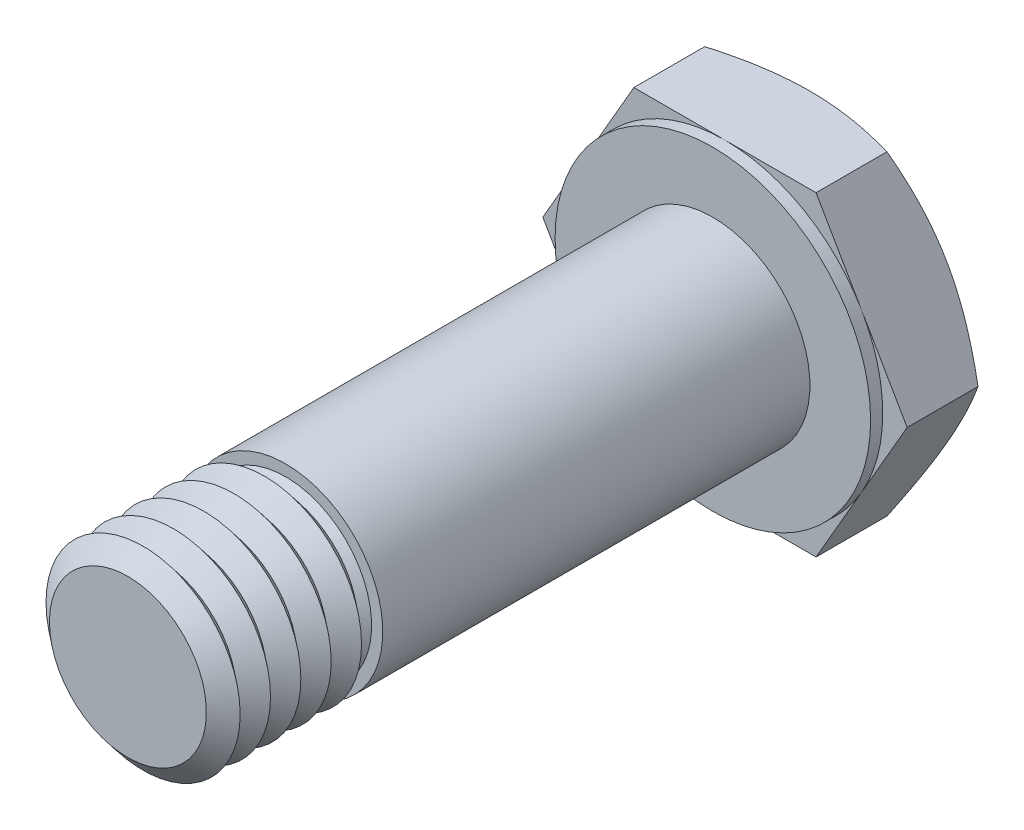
ISO-10303-21;
HEADER;
FILE_DESCRIPTION(('STEP AP214'),'2;1');
FILE_NAME('part.step','',(''),(''),'','','');
FILE_SCHEMA(('AUTOMOTIVE_DESIGN { 1 0 10303 214 1 1 1 1 }'));
ENDSEC;
DATA;
#1=APPLICATION_CONTEXT('core data for automotive mechanical design processes');
#2=APPLICATION_PROTOCOL_DEFINITION('international standard','automotive_design',2000,#1);
#3=PRODUCT_CONTEXT('',#1,'mechanical');
#4=PRODUCT('Part','Part','',(#3));
#5=PRODUCT_RELATED_PRODUCT_CATEGORY('part','',(#4));
#6=PRODUCT_DEFINITION_FORMATION('','',#4);
#7=PRODUCT_DEFINITION_CONTEXT('part definition',#1,'design');
#8=PRODUCT_DEFINITION('design','',#6,#7);
#9=PRODUCT_DEFINITION_SHAPE('','',#8);
#10=(LENGTH_UNIT() NAMED_UNIT(*) SI_UNIT(.MILLI.,.METRE.));
#11=(NAMED_UNIT(*) PLANE_ANGLE_UNIT() SI_UNIT($,.RADIAN.));
#12=(NAMED_UNIT(*) SI_UNIT($,.STERADIAN.) SOLID_ANGLE_UNIT());
#13=UNCERTAINTY_MEASURE_WITH_UNIT(LENGTH_MEASURE(1.E-05),#10,'distance_accuracy_value','');
#14=(GEOMETRIC_REPRESENTATION_CONTEXT(3) GLOBAL_UNCERTAINTY_ASSIGNED_CONTEXT((#13)) GLOBAL_UNIT_ASSIGNED_CONTEXT((#10,
#11,#12)) REPRESENTATION_CONTEXT('',''));
#15=CARTESIAN_POINT('',(0.,0.,0.));
#16=DIRECTION('',(0.,0.,1.));
#17=DIRECTION('',(1.,0.,0.));
#18=AXIS2_PLACEMENT_3D('',#15,#16,#17);
#19=CARTESIAN_POINT('',(0.,0.,24.1000000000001));
#20=DIRECTION('',(0.,0.,-1.));
#21=DIRECTION('',(-1.,0.,0.));
#22=AXIS2_PLACEMENT_3D('',#19,#20,#21);
#23=PLANE('',#22);
#24=CARTESIAN_POINT('',(0.,0.,24.1000000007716));
#25=DIRECTION('',(0.,0.,-1.));
#26=DIRECTION('',(-1.,0.,0.));
#27=AXIS2_PLACEMENT_3D('',#24,#25,#26);
#28=CIRCLE('',#27,3.23300000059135);
#29=CARTESIAN_POINT('',(-3.23300000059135,0.,24.1000000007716));
#30=VERTEX_POINT('',#29);
#31=EDGE_CURVE('E19',#30,#30,#28,.T.);
#32=ORIENTED_EDGE('',*,*,#31,.F.);
#33=EDGE_LOOP('',(#32));
#34=FACE_BOUND('',#33,.T.);
#35=ADVANCED_FACE('F16',(#34),#23,.F.);
#36=CARTESIAN_POINT('',(0.,0.,23.475000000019));
#37=DIRECTION('',(0.,0.,-1.));
#38=DIRECTION('',(-1.,0.,0.));
#39=AXIS2_PLACEMENT_3D('',#36,#37,#38);
#40=CONICAL_SURFACE('',#39,3.99999999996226,0.887057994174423);
#41=CARTESIAN_POINT('',(0.,0.,23.475000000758));
#42=DIRECTION('',(0.,0.,1.));
#43=DIRECTION('',(1.,0.,0.));
#44=AXIS2_PLACEMENT_3D('',#41,#42,#43);
#45=CIRCLE('',#44,3.99999999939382);
#46=CARTESIAN_POINT('',(3.99999999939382,0.,23.475000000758));
#47=VERTEX_POINT('',#46);
#48=EDGE_CURVE('E357',#47,#47,#45,.F.);
#49=ORIENTED_EDGE('',*,*,#48,.F.);
#50=EDGE_LOOP('',(#49));
#51=FACE_BOUND('',#50,.T.);
#52=ORIENTED_EDGE('',*,*,#31,.T.);
#53=EDGE_LOOP('',(#52));
#54=FACE_BOUND('',#53,.T.);
#55=ADVANCED_FACE('F436',(#51,#54),#40,.T.);
#56=CARTESIAN_POINT('',(0.,0.,23.4750000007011));
#57=DIRECTION('',(0.,0.,1.));
#58=DIRECTION('',(1.,0.,0.));
#59=AXIS2_PLACEMENT_3D('',#56,#57,#58);
#60=CONICAL_SURFACE('',#59,3.99999999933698,0.887057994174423);
#61=CARTESIAN_POINT('',(0.,0.,22.8500000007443));
#62=DIRECTION('',(0.,0.,-1.));
#63=DIRECTION('',(1.,0.,0.));
#64=AXIS2_PLACEMENT_3D('',#61,#62,#63);
#65=CIRCLE('',#64,3.23300000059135);
#66=CARTESIAN_POINT('',(3.23300000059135,0.,22.8500000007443));
#67=VERTEX_POINT('',#66);
#68=EDGE_CURVE('E352',#67,#67,#65,.T.);
#69=ORIENTED_EDGE('',*,*,#68,.F.);
#70=EDGE_LOOP('',(#69));
#71=FACE_BOUND('',#70,.T.);
#72=ORIENTED_EDGE('',*,*,#48,.T.);
#73=EDGE_LOOP('',(#72));
#74=FACE_BOUND('',#73,.T.);
#75=ADVANCED_FACE('F430',(#71,#74),#60,.T.);
#76=CARTESIAN_POINT('',(0.,0.,22.2249999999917));
#77=DIRECTION('',(0.,0.,-1.));
#78=DIRECTION('',(-1.,0.,0.));
#79=AXIS2_PLACEMENT_3D('',#76,#77,#78);
#80=CONICAL_SURFACE('',#79,3.99999999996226,0.887057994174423);
#81=CARTESIAN_POINT('',(0.,0.,22.2250000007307));
#82=DIRECTION('',(0.,0.,1.));
#83=DIRECTION('',(1.,0.,0.));
#84=AXIS2_PLACEMENT_3D('',#81,#82,#83);
#85=CIRCLE('',#84,3.99999999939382);
#86=CARTESIAN_POINT('',(3.99999999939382,0.,22.2250000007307));
#87=VERTEX_POINT('',#86);
#88=EDGE_CURVE('E347',#87,#87,#85,.F.);
#89=ORIENTED_EDGE('',*,*,#88,.F.);
#90=EDGE_LOOP('',(#89));
#91=FACE_BOUND('',#90,.T.);
#92=ORIENTED_EDGE('',*,*,#68,.T.);
#93=EDGE_LOOP('',(#92));
#94=FACE_BOUND('',#93,.T.);
#95=ADVANCED_FACE('F424',(#91,#94),#80,.T.);
#96=CARTESIAN_POINT('',(0.,0.,22.2250000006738));
#97=DIRECTION('',(0.,0.,1.));
#98=DIRECTION('',(1.,0.,0.));
#99=AXIS2_PLACEMENT_3D('',#96,#97,#98);
#100=CONICAL_SURFACE('',#99,3.99999999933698,0.887057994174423);
#101=CARTESIAN_POINT('',(0.,0.,21.6000000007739));
#102=DIRECTION('',(0.,0.,-1.));
#103=DIRECTION('',(1.,0.,0.));
#104=AXIS2_PLACEMENT_3D('',#101,#102,#103);
#105=CIRCLE('',#104,3.23300000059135);
#106=CARTESIAN_POINT('',(3.23300000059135,0.,21.6000000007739));
#107=VERTEX_POINT('',#106);
#108=EDGE_CURVE('E342',#107,#107,#105,.T.);
#109=ORIENTED_EDGE('',*,*,#108,.F.);
#110=EDGE_LOOP('',(#109));
#111=FACE_BOUND('',#110,.T.);
#112=ORIENTED_EDGE('',*,*,#88,.T.);
#113=EDGE_LOOP('',(#112));
#114=FACE_BOUND('',#113,.T.);
#115=ADVANCED_FACE('F418',(#111,#114),#100,.T.);
#116=CARTESIAN_POINT('',(0.,0.,20.9750000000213));
#117=DIRECTION('',(0.,0.,-1.));
#118=DIRECTION('',(-1.,0.,0.));
#119=AXIS2_PLACEMENT_3D('',#116,#117,#118);
#120=CONICAL_SURFACE('',#119,3.99999999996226,0.887057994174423);
#121=CARTESIAN_POINT('',(0.,0.,20.9750000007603));
#122=DIRECTION('',(0.,0.,1.));
#123=DIRECTION('',(1.,0.,0.));
#124=AXIS2_PLACEMENT_3D('',#121,#122,#123);
#125=CIRCLE('',#124,3.99999999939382);
#126=CARTESIAN_POINT('',(3.99999999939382,0.,20.9750000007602));
#127=VERTEX_POINT('',#126);
#128=EDGE_CURVE('E337',#127,#127,#125,.F.);
#129=ORIENTED_EDGE('',*,*,#128,.F.);
#130=EDGE_LOOP('',(#129));
#131=FACE_BOUND('',#130,.T.);
#132=ORIENTED_EDGE('',*,*,#108,.T.);
#133=EDGE_LOOP('',(#132));
#134=FACE_BOUND('',#133,.T.);
#135=ADVANCED_FACE('F412',(#131,#134),#120,.T.);
#136=CARTESIAN_POINT('',(0.,0.,20.9750000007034));
#137=DIRECTION('',(0.,0.,1.));
#138=DIRECTION('',(1.,0.,0.));
#139=AXIS2_PLACEMENT_3D('',#136,#137,#138);
#140=CONICAL_SURFACE('',#139,3.99999999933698,0.887057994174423);
#141=CARTESIAN_POINT('',(0.,0.,20.3500000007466));
#142=DIRECTION('',(0.,0.,-1.));
#143=DIRECTION('',(1.,0.,0.));
#144=AXIS2_PLACEMENT_3D('',#141,#142,#143);
#145=CIRCLE('',#144,3.23300000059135);
#146=CARTESIAN_POINT('',(3.23300000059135,0.,20.3500000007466));
#147=VERTEX_POINT('',#146);
#148=EDGE_CURVE('E101',#147,#147,#145,.T.);
#149=ORIENTED_EDGE('',*,*,#148,.F.);
#150=EDGE_LOOP('',(#149));
#151=FACE_BOUND('',#150,.T.);
#152=ORIENTED_EDGE('',*,*,#128,.T.);
#153=EDGE_LOOP('',(#152));
#154=FACE_BOUND('',#153,.T.);
#155=ADVANCED_FACE('F409',(#151,#154),#140,.T.);
#156=CARTESIAN_POINT('',(0.,0.,-4.));
#157=DIRECTION('',(0.,0.,-1.));
#158=DIRECTION('',(-1.,0.,0.));
#159=AXIS2_PLACEMENT_3D('',#156,#157,#158);
#160=PLANE('',#159);
#161=CARTESIAN_POINT('',(0.,0.,-4.00000000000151));
#162=DIRECTION('',(0.,0.,1.));
#163=DIRECTION('',(1.,0.,0.));
#164=AXIS2_PLACEMENT_3D('',#161,#162,#163);
#165=CIRCLE('',#164,6.50000000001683);
#166=CARTESIAN_POINT('',(-5.62916512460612,3.25000000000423,-4.00000000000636));
#167=VERTEX_POINT('',#166);
#168=CARTESIAN_POINT('',(-5.62916512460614,-3.25000000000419,-4.00000000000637));
#169=VERTEX_POINT('',#168);
#170=EDGE_CURVE('E93',#167,#169,#165,.T.);
#171=ORIENTED_EDGE('',*,*,#170,.F.);
#172=CARTESIAN_POINT('',(0.,0.,-4.00000000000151));
#173=DIRECTION('',(0.,0.,1.));
#174=DIRECTION('',(1.,0.,0.));
#175=AXIS2_PLACEMENT_3D('',#172,#173,#174);
#176=CIRCLE('',#175,6.50000000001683);
#177=CARTESIAN_POINT('',(0.,6.50000000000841,-4.00000000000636));
#178=VERTEX_POINT('',#177);
#179=EDGE_CURVE('E130',#178,#167,#176,.T.);
#180=ORIENTED_EDGE('',*,*,#179,.F.);
#181=CARTESIAN_POINT('',(0.,0.,-4.00000000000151));
#182=DIRECTION('',(0.,0.,1.));
#183=DIRECTION('',(1.,0.,0.));
#184=AXIS2_PLACEMENT_3D('',#181,#182,#183);
#185=CIRCLE('',#184,6.50000000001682);
#186=CARTESIAN_POINT('',(5.62916512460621,3.25000000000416,-4.00000000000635));
#187=VERTEX_POINT('',#186);
#188=EDGE_CURVE('E111',#187,#178,#185,.T.);
#189=ORIENTED_EDGE('',*,*,#188,.F.);
#190=CARTESIAN_POINT('',(0.,0.,-4.00000000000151));
#191=DIRECTION('',(0.,0.,1.));
#192=DIRECTION('',(1.,0.,0.));
#193=AXIS2_PLACEMENT_3D('',#190,#191,#192);
#194=CIRCLE('',#193,6.50000000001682);
#195=CARTESIAN_POINT('',(5.62916512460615,-3.25000000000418,-4.00000000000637));
#196=VERTEX_POINT('',#195);
#197=EDGE_CURVE('E112',#196,#187,#194,.T.);
#198=ORIENTED_EDGE('',*,*,#197,.F.);
#199=CARTESIAN_POINT('',(0.,0.,-4.00000000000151));
#200=DIRECTION('',(0.,0.,1.));
#201=DIRECTION('',(1.,0.,0.));
#202=AXIS2_PLACEMENT_3D('',#199,#200,#201);
#203=CIRCLE('',#202,6.50000000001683);
#204=CARTESIAN_POINT('',(0.,-6.50000000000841,-4.00000000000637));
#205=VERTEX_POINT('',#204);
#206=EDGE_CURVE('E96',#205,#196,#203,.T.);
#207=ORIENTED_EDGE('',*,*,#206,.F.);
#208=CARTESIAN_POINT('',(0.,0.,-4.00000000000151));
#209=DIRECTION('',(0.,0.,1.));
#210=DIRECTION('',(1.,0.,0.));
#211=AXIS2_PLACEMENT_3D('',#208,#209,#210);
#212=CIRCLE('',#211,6.50000000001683);
#213=EDGE_CURVE('E90',#169,#205,#212,.T.);
#214=ORIENTED_EDGE('',*,*,#213,.F.);
#215=EDGE_LOOP('',(#171,#180,#189,#198,#207,#214));
#216=FACE_BOUND('',#215,.T.);
#217=ADVANCED_FACE('F92',(#216),#160,.T.);
#218=CARTESIAN_POINT('',(0.,0.,19.724999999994));
#219=DIRECTION('',(0.,0.,-1.));
#220=DIRECTION('',(-1.,0.,0.));
#221=AXIS2_PLACEMENT_3D('',#218,#219,#220);
#222=CONICAL_SURFACE('',#221,3.99999999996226,0.887057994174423);
#223=CARTESIAN_POINT('',(0.,0.,19.725000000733));
#224=DIRECTION('',(0.,0.,1.));
#225=DIRECTION('',(1.,0.,0.));
#226=AXIS2_PLACEMENT_3D('',#223,#224,#225);
#227=CIRCLE('',#226,3.99999999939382);
#228=CARTESIAN_POINT('',(3.99999999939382,0.,19.725000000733));
#229=VERTEX_POINT('',#228);
#230=EDGE_CURVE('E127',#229,#229,#227,.F.);
#231=ORIENTED_EDGE('',*,*,#230,.F.);
#232=EDGE_LOOP('',(#231));
#233=FACE_BOUND('',#232,.T.);
#234=ORIENTED_EDGE('',*,*,#148,.T.);
#235=EDGE_LOOP('',(#234));
#236=FACE_BOUND('',#235,.T.);
#237=ADVANCED_FACE('F229',(#233,#236),#222,.T.);
#238=CARTESIAN_POINT('',(0.,0.,-3.41596007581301));
#239=DIRECTION('',(0.,0.,1.));
#240=DIRECTION('',(1.,0.,0.));
#241=AXIS2_PLACEMENT_3D('',#238,#239,#240);
#242=CONICAL_SURFACE('',#241,7.51158681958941,1.04719755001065);
#243=CARTESIAN_POINT('',(-5.62916512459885,-3.24999999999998,-4.00000000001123));
#244=CARTESIAN_POINT('',(-5.54952296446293,-3.38794426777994,-4.00002656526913));
#245=CARTESIAN_POINT('',(-5.46988464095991,-3.52588189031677,-3.99662027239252));
#246=CARTESIAN_POINT('',(-5.31076436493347,-3.80148629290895,-3.98313941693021));
#247=CARTESIAN_POINT('',(-5.23128238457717,-3.93915312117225,-3.97306617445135));
#248=CARTESIAN_POINT('',(-5.07298818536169,-4.21332671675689,-3.94651519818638));
#249=CARTESIAN_POINT('',(-4.99417460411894,-4.3498358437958,-3.93006970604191));
#250=CARTESIAN_POINT('',(-4.83692293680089,-4.62220372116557,-3.89112797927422));
#251=CARTESIAN_POINT('',(-4.7584848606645,-4.75806245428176,-3.86863158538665));
#252=CARTESIAN_POINT('',(-4.52405902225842,-5.16409991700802,-3.79276102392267));
#253=CARTESIAN_POINT('',(-4.36875227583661,-5.43309909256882,-3.73096863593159));
#254=CARTESIAN_POINT('',(-4.05947435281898,-5.96878416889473,-3.58845958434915));
#255=CARTESIAN_POINT('',(-3.90551396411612,-6.23545138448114,-3.50764840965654));
#256=CARTESIAN_POINT('',(-3.75277674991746,-6.49999999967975,-3.41944341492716));
#257=B_SPLINE_CURVE_WITH_KNOTS('',3,(#243,#244,#245,#246,#247,#248,#249,#250,#251,#252,#253,
#254,#255,#256),.UNSPECIFIED.,.F.,.F.,(4,2,2,2,2,2,4),(0.,0.477804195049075,0.955513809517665,
1.4308372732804,1.9061732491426,2.85559935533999,3.8098470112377),.UNSPECIFIED.);
#258=CARTESIAN_POINT('',(-3.75277674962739,-6.49999999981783,-3.41944341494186));
#259=VERTEX_POINT('',#258);
#260=EDGE_CURVE('E114',#169,#259,#257,.T.);
#261=ORIENTED_EDGE('',*,*,#260,.F.);
#262=ORIENTED_EDGE('',*,*,#213,.T.);
#263=CARTESIAN_POINT('',(-3.75277674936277,-6.50000000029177,-3.41944341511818));
#264=CARTESIAN_POINT('',(-3.44730232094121,-6.50000000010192,-3.50764840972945));
#265=CARTESIAN_POINT('',(-3.13938154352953,-6.50000000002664,-3.58845958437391));
#266=CARTESIAN_POINT('',(-2.52082569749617,-6.4999999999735,-3.7309686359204));
#267=CARTESIAN_POINT('',(-2.21021220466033,-6.49999999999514,-3.79276102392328));
#268=CARTESIAN_POINT('',(-1.74136052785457,-6.50000000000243,-3.86863158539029));
#269=CARTESIAN_POINT('',(-1.58448437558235,-6.50000000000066,-3.89112797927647));
#270=CARTESIAN_POINT('',(-1.2699810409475,-6.49999999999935,-3.93006970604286));
#271=CARTESIAN_POINT('',(-1.11235387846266,-6.49999999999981,-3.94651519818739));
#272=CARTESIAN_POINT('',(-0.795765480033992,-6.50000000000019,-3.9730661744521));
#273=CARTESIAN_POINT('',(-0.636801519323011,-6.5000000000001,-3.98313941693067));
#274=CARTESIAN_POINT('',(-0.318560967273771,-6.49999999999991,-3.99662027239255));
#275=CARTESIAN_POINT('',(-0.159284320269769,-6.49999999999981,-4.00002656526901));
#276=CARTESIAN_POINT('',(0.,-6.5,-4.00000000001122));
#277=B_SPLINE_CURVE_WITH_KNOTS('',3,(#263,#264,#265,#266,#267,#268,#269,#270,#271,#272,#273,
#274,#275,#276),.UNSPECIFIED.,.F.,.F.,(4,2,2,2,2,2,4),(0.,0.954247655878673,1.90367376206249,
2.37900973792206,2.85433320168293,3.3320428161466,3.80984701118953),.UNSPECIFIED.);
#278=EDGE_CURVE('E117',#259,#205,#277,.T.);
#279=ORIENTED_EDGE('',*,*,#278,.F.);
#280=EDGE_LOOP('',(#261,#262,#279));
#281=FACE_BOUND('',#280,.T.);
#282=ADVANCED_FACE('F115',(#281),#242,.T.);
#283=CARTESIAN_POINT('',(0.,0.,-3.41596007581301));
#284=DIRECTION('',(0.,0.,1.));
#285=DIRECTION('',(1.,0.,0.));
#286=AXIS2_PLACEMENT_3D('',#283,#284,#285);
#287=CONICAL_SURFACE('',#286,7.51158681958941,1.04719755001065);
#288=CARTESIAN_POINT('',(0.,-6.5,-4.00000000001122));
#289=CARTESIAN_POINT('',(0.159284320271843,-6.5,-4.00002656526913));
#290=CARTESIAN_POINT('',(0.318560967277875,-6.5,-3.99662027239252));
#291=CARTESIAN_POINT('',(0.636801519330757,-6.5,-3.9831394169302));
#292=CARTESIAN_POINT('',(0.795765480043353,-6.5,-3.97306617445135));
#293=CARTESIAN_POINT('',(1.11235387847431,-6.5,-3.94651519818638));
#294=CARTESIAN_POINT('',(1.26998104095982,-6.5,-3.93006970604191));
#295=CARTESIAN_POINT('',(1.58448437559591,-6.5,-3.89112797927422));
#296=CARTESIAN_POINT('',(1.74136052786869,-6.5,-3.86863158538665));
#297=CARTESIAN_POINT('',(2.21021220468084,-6.5,-3.79276102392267));
#298=CARTESIAN_POINT('',(2.52082569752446,-6.5,-3.73096863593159));
#299=CARTESIAN_POINT('',(3.13938154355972,-6.5,-3.58845958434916));
#300=CARTESIAN_POINT('',(3.44730232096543,-6.5,-3.50764840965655));
#301=CARTESIAN_POINT('',(3.75277674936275,-6.5,-3.41944341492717));
#302=B_SPLINE_CURVE_WITH_KNOTS('',3,(#288,#289,#290,#291,#292,#293,#294,#295,#296,#297,#298,
#299,#300,#301),.UNSPECIFIED.,.F.,.F.,(4,2,2,2,2,2,4),(0.,0.477804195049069,0.955513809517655,
1.43083727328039,1.90617324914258,2.85559935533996,3.80984701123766),.UNSPECIFIED.);
#303=CARTESIAN_POINT('',(3.75277674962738,-6.49999999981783,-3.41944341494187));
#304=VERTEX_POINT('',#303);
#305=EDGE_CURVE('E217',#205,#304,#302,.T.);
#306=ORIENTED_EDGE('',*,*,#305,.F.);
#307=ORIENTED_EDGE('',*,*,#206,.T.);
#308=CARTESIAN_POINT('',(3.75277675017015,-6.49999999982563,-3.4194434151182));
#309=CARTESIAN_POINT('',(3.9055139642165,-6.2354513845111,-3.50764840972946));
#310=CARTESIAN_POINT('',(4.05947435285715,-5.96878416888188,-3.58845958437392));
#311=CARTESIAN_POINT('',(4.36875227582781,-5.43309909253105,-3.73096863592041));
#312=CARTESIAN_POINT('',(4.52405902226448,-5.16409991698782,-3.79276102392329));
#313=CARTESIAN_POINT('',(4.75848486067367,-4.75806245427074,-3.8686315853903));
#314=CARTESIAN_POINT('',(4.83692293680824,-4.62220372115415,-3.89112797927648));
#315=CARTESIAN_POINT('',(4.99417460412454,-4.34983584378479,-3.93006970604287));
#316=CARTESIAN_POINT('',(5.07298818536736,-4.2133267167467,-3.9465151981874));
#317=CARTESIAN_POINT('',(5.23128238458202,-3.93915312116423,-3.97306617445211));
#318=CARTESIAN_POINT('',(5.31076436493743,-3.80148629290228,-3.98313941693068));
#319=CARTESIAN_POINT('',(5.46988464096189,-3.52588189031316,-3.99662027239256));
#320=CARTESIAN_POINT('',(5.54952296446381,-3.38794426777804,-4.00002656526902));
#321=CARTESIAN_POINT('',(5.62916512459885,-3.24999999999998,-4.00000000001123));
#322=B_SPLINE_CURVE_WITH_KNOTS('',3,(#308,#309,#310,#311,#312,#313,#314,#315,#316,#317,#318,
#319,#320,#321),.UNSPECIFIED.,.F.,.F.,(4,2,2,2,2,2,4),(0.,0.954247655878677,1.9036737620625,
2.37900973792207,2.85433320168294,3.33204281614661,3.80984701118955),.UNSPECIFIED.);
#323=EDGE_CURVE('E210',#304,#196,#322,.T.);
#324=ORIENTED_EDGE('',*,*,#323,.F.);
#325=EDGE_LOOP('',(#306,#307,#324));
#326=FACE_BOUND('',#325,.T.);
#327=ADVANCED_FACE('F221',(#326),#287,.T.);
#328=CARTESIAN_POINT('',(0.,0.,-3.41596007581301));
#329=DIRECTION('',(0.,0.,1.));
#330=DIRECTION('',(1.,0.,0.));
#331=AXIS2_PLACEMENT_3D('',#328,#329,#330);
#332=CONICAL_SURFACE('',#331,7.51158681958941,1.04719755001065);
#333=ORIENTED_EDGE('',*,*,#197,.T.);
#334=CARTESIAN_POINT('',(7.50555349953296,4.66183082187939E-10,-3.41944341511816));
#335=CARTESIAN_POINT('',(7.35281628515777,0.264548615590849,-3.50764840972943));
#336=CARTESIAN_POINT('',(7.19885589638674,0.531215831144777,-3.58845958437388));
#337=CARTESIAN_POINT('',(6.88957797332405,1.06690090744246,-3.73096863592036));
#338=CARTESIAN_POINT('',(6.73427122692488,1.33590008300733,-3.79276102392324));
#339=CARTESIAN_POINT('',(6.49984538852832,1.74193754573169,-3.86863158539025));
#340=CARTESIAN_POINT('',(6.42140731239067,1.8777962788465,-3.89112797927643));
#341=CARTESIAN_POINT('',(6.26415564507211,2.15016415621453,-3.93006970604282));
#342=CARTESIAN_POINT('',(6.1853420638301,2.28667328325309,-3.94651519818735));
#343=CARTESIAN_POINT('',(6.0270478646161,2.56084687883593,-3.97306617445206));
#344=CARTESIAN_POINT('',(5.94756588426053,2.69851370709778,-3.98313941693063));
#345=CARTESIAN_POINT('',(5.78844560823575,2.9741181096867,-3.9966202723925));
#346=CARTESIAN_POINT('',(5.70880728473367,3.11205573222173,-4.00002656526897));
#347=CARTESIAN_POINT('',(5.62916512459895,3.24999999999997,-4.00000000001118));
#348=B_SPLINE_CURVE_WITH_KNOTS('',3,(#334,#335,#336,#337,#338,#339,#340,#341,#342,#343,#344,
#345,#346,#347),.UNSPECIFIED.,.F.,.F.,(4,2,2,2,2,2,4),(0.,0.95424765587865,1.90367376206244,
2.379009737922,2.85433320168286,3.33204281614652,3.80984701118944),.UNSPECIFIED.);
#349=CARTESIAN_POINT('',(7.50555349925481,0.,-3.41944341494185));
#350=VERTEX_POINT('',#349);
#351=EDGE_CURVE('E198',#350,#187,#348,.T.);
#352=ORIENTED_EDGE('',*,*,#351,.F.);
#353=CARTESIAN_POINT('',(5.62916512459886,-3.24999999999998,-4.00000000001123));
#354=CARTESIAN_POINT('',(5.70880728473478,-3.11205573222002,-4.00002656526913));
#355=CARTESIAN_POINT('',(5.78844560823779,-2.97411810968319,-3.99662027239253));
#356=CARTESIAN_POINT('',(5.94756588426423,-2.69851370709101,-3.98313941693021));
#357=CARTESIAN_POINT('',(6.02704786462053,-2.56084687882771,-3.97306617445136));
#358=CARTESIAN_POINT('',(6.18534206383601,-2.28667328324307,-3.94651519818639));
#359=CARTESIAN_POINT('',(6.26415564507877,-2.15016415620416,-3.93006970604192));
#360=CARTESIAN_POINT('',(6.42140731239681,-1.87779627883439,-3.89112797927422));
#361=CARTESIAN_POINT('',(6.4998453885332,-1.74193754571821,-3.86863158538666));
#362=CARTESIAN_POINT('',(6.73427122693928,-1.33590008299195,-3.79276102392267));
#363=CARTESIAN_POINT('',(6.88957797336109,-1.06690090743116,-3.73096863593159));
#364=CARTESIAN_POINT('',(7.19885589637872,-0.531215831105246,-3.58845958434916));
#365=CARTESIAN_POINT('',(7.35281628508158,-0.264548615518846,-3.50764840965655));
#366=CARTESIAN_POINT('',(7.50555349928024,-3.20235474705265E-10,-3.41944341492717));
#367=B_SPLINE_CURVE_WITH_KNOTS('',3,(#353,#354,#355,#356,#357,#358,#359,#360,#361,#362,#363,
#364,#365,#366),.UNSPECIFIED.,.F.,.F.,(4,2,2,2,2,2,4),(0.,0.47780419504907,0.955513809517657,
1.43083727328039,1.90617324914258,2.85559935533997,3.80984701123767),.UNSPECIFIED.);
#368=EDGE_CURVE('E205',#196,#350,#367,.T.);
#369=ORIENTED_EDGE('',*,*,#368,.F.);
#370=EDGE_LOOP('',(#333,#352,#369));
#371=FACE_BOUND('',#370,.T.);
#372=ADVANCED_FACE('F152',(#371),#332,.T.);
#373=CARTESIAN_POINT('',(0.,0.,-3.41596007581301));
#374=DIRECTION('',(0.,0.,1.));
#375=DIRECTION('',(1.,0.,0.));
#376=AXIS2_PLACEMENT_3D('',#373,#374,#375);
#377=CONICAL_SURFACE('',#376,7.51158681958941,1.04719755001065);
#378=CARTESIAN_POINT('',(-5.62916512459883,3.25000000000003,-4.00000000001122));
#379=CARTESIAN_POINT('',(-5.70880728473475,3.11205573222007,-4.00002656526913));
#380=CARTESIAN_POINT('',(-5.78844560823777,2.97411810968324,-3.99662027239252));
#381=CARTESIAN_POINT('',(-5.94756588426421,2.69851370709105,-3.9831394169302));
#382=CARTESIAN_POINT('',(-6.02704786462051,2.56084687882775,-3.97306617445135));
#383=CARTESIAN_POINT('',(-6.18534206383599,2.28667328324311,-3.94651519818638));
#384=CARTESIAN_POINT('',(-6.26415564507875,2.1501641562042,-3.93006970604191));
#385=CARTESIAN_POINT('',(-6.42140731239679,1.87779627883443,-3.89112797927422));
#386=CARTESIAN_POINT('',(-6.49984538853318,1.74193754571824,-3.86863158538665));
#387=CARTESIAN_POINT('',(-6.73427122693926,1.33590008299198,-3.79276102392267));
#388=CARTESIAN_POINT('',(-6.88957797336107,1.06690090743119,-3.73096863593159));
#389=CARTESIAN_POINT('',(-7.19885589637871,0.531215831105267,-3.58845958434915));
#390=CARTESIAN_POINT('',(-7.35281628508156,0.264548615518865,-3.50764840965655));
#391=CARTESIAN_POINT('',(-7.50555349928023,3.20252152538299E-10,-3.41944341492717));
#392=B_SPLINE_CURVE_WITH_KNOTS('',3,(#378,#379,#380,#381,#382,#383,#384,#385,#386,#387,#388,
#389,#390,#391),.UNSPECIFIED.,.F.,.F.,(4,2,2,2,2,2,4),(0.,0.477804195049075,0.955513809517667,
1.43083727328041,1.9061732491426,2.85559935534,3.8098470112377),.UNSPECIFIED.);
#393=CARTESIAN_POINT('',(-7.50555349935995,-1.82164817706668E-10,-3.41944341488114));
#394=VERTEX_POINT('',#393);
#395=EDGE_CURVE('E109',#167,#394,#392,.T.);
#396=ORIENTED_EDGE('',*,*,#395,.F.);
#397=ORIENTED_EDGE('',*,*,#170,.T.);
#398=CARTESIAN_POINT('',(-7.50555349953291,-4.66133003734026E-10,-3.41944341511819));
#399=CARTESIAN_POINT('',(-7.35281628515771,-0.264548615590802,-3.50764840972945));
#400=CARTESIAN_POINT('',(-7.19885589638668,-0.531215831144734,-3.58845958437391));
#401=CARTESIAN_POINT('',(-6.88957797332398,-1.06690090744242,-3.7309686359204));
#402=CARTESIAN_POINT('',(-6.73427122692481,-1.3359000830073,-3.79276102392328));
#403=CARTESIAN_POINT('',(-6.49984538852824,-1.74193754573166,-3.86863158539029));
#404=CARTESIAN_POINT('',(-6.42140731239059,-1.87779627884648,-3.89112797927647));
#405=CARTESIAN_POINT('',(-6.26415564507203,-2.15016415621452,-3.93006970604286));
#406=CARTESIAN_POINT('',(-6.18534206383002,-2.28667328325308,-3.94651519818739));
#407=CARTESIAN_POINT('',(-6.02704786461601,-2.56084687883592,-3.9730661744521));
#408=CARTESIAN_POINT('',(-5.94756588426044,-2.69851370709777,-3.98313941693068));
#409=CARTESIAN_POINT('',(-5.78844560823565,-2.9741181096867,-3.99662027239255));
#410=CARTESIAN_POINT('',(-5.70880728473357,-3.11205573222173,-4.00002656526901));
#411=CARTESIAN_POINT('',(-5.62916512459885,-3.24999999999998,-4.00000000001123));
#412=B_SPLINE_CURVE_WITH_KNOTS('',3,(#398,#399,#400,#401,#402,#403,#404,#405,#406,#407,#408,
#409,#410,#411),.UNSPECIFIED.,.F.,.F.,(4,2,2,2,2,2,4),(0.,0.95424765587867,1.90367376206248,
2.37900973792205,2.85433320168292,3.33204281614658,3.80984701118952),.UNSPECIFIED.);
#413=EDGE_CURVE('E106',#394,#169,#412,.T.);
#414=ORIENTED_EDGE('',*,*,#413,.F.);
#415=EDGE_LOOP('',(#396,#397,#414));
#416=FACE_BOUND('',#415,.T.);
#417=ADVANCED_FACE('F104',(#416),#377,.T.);
#418=CARTESIAN_POINT('',(0.,0.,-3.41596007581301));
#419=DIRECTION('',(0.,0.,1.));
#420=DIRECTION('',(1.,0.,0.));
#421=AXIS2_PLACEMENT_3D('',#418,#419,#420);
#422=CONICAL_SURFACE('',#421,7.51158681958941,1.04719755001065);
#423=ORIENTED_EDGE('',*,*,#188,.T.);
#424=CARTESIAN_POINT('',(3.75277674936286,6.50000000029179,-3.41944341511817));
#425=CARTESIAN_POINT('',(3.4473023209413,6.50000000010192,-3.50764840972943));
#426=CARTESIAN_POINT('',(3.1393815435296,6.50000000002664,-3.58845958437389));
#427=CARTESIAN_POINT('',(2.52082569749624,6.4999999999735,-3.73096863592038));
#428=CARTESIAN_POINT('',(2.21021220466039,6.49999999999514,-3.79276102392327));
#429=CARTESIAN_POINT('',(1.74136052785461,6.50000000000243,-3.86863158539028));
#430=CARTESIAN_POINT('',(1.58448437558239,6.50000000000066,-3.89112797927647));
#431=CARTESIAN_POINT('',(1.26998104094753,6.49999999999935,-3.93006970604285));
#432=CARTESIAN_POINT('',(1.11235387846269,6.49999999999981,-3.94651519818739));
#433=CARTESIAN_POINT('',(0.795765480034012,6.50000000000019,-3.9730661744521));
#434=CARTESIAN_POINT('',(0.636801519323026,6.5000000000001,-3.98313941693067));
#435=CARTESIAN_POINT('',(0.318560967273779,6.49999999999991,-3.99662027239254));
#436=CARTESIAN_POINT('',(0.159284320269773,6.49999999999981,-4.00002656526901));
#437=CARTESIAN_POINT('',(0.,6.5,-4.00000000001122));
#438=B_SPLINE_CURVE_WITH_KNOTS('',3,(#424,#425,#426,#427,#428,#429,#430,#431,#432,#433,#434,
#435,#436,#437),.UNSPECIFIED.,.F.,.F.,(4,2,2,2,2,2,4),(0.,0.954247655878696,1.90367376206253,
2.37900973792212,2.854333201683,3.33204281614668,3.80984701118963),.UNSPECIFIED.);
#439=CARTESIAN_POINT('',(3.75277674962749,6.49999999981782,-3.41944341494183));
#440=VERTEX_POINT('',#439);
#441=EDGE_CURVE('E166',#440,#178,#438,.T.);
#442=ORIENTED_EDGE('',*,*,#441,.F.);
#443=CARTESIAN_POINT('',(5.62916512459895,3.24999999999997,-4.00000000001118));
#444=CARTESIAN_POINT('',(5.54952296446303,3.38794426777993,-4.00002656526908));
#445=CARTESIAN_POINT('',(5.46988464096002,3.52588189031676,-3.99662027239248));
#446=CARTESIAN_POINT('',(5.31076436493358,3.80148629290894,-3.98313941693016));
#447=CARTESIAN_POINT('',(5.23128238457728,3.93915312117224,-3.97306617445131));
#448=CARTESIAN_POINT('',(5.0729881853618,4.21332671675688,-3.94651519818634));
#449=CARTESIAN_POINT('',(4.99417460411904,4.34983584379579,-3.93006970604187));
#450=CARTESIAN_POINT('',(4.836922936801,4.62220372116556,-3.89112797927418));
#451=CARTESIAN_POINT('',(4.75848486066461,4.75806245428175,-3.86863158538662));
#452=CARTESIAN_POINT('',(4.52405902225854,5.16409991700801,-3.79276102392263));
#453=CARTESIAN_POINT('',(4.36875227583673,5.4330990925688,-3.73096863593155));
#454=CARTESIAN_POINT('',(4.0594743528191,5.96878416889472,-3.58845958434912));
#455=CARTESIAN_POINT('',(3.90551396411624,6.23545138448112,-3.50764840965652));
#456=CARTESIAN_POINT('',(3.75277674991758,6.49999999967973,-3.41944341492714));
#457=B_SPLINE_CURVE_WITH_KNOTS('',3,(#443,#444,#445,#446,#447,#448,#449,#450,#451,#452,#453,
#454,#455,#456),.UNSPECIFIED.,.F.,.F.,(4,2,2,2,2,2,4),(0.,0.477804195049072,0.955513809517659,
1.43083727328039,1.90617324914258,2.85559935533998,3.80984701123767),.UNSPECIFIED.);
#458=EDGE_CURVE('E193',#187,#440,#457,.T.);
#459=ORIENTED_EDGE('',*,*,#458,.F.);
#460=EDGE_LOOP('',(#423,#442,#459));
#461=FACE_BOUND('',#460,.T.);
#462=ADVANCED_FACE('F151',(#461),#422,.T.);
#463=CARTESIAN_POINT('',(0.,0.,-3.41596007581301));
#464=DIRECTION('',(0.,0.,1.));
#465=DIRECTION('',(1.,0.,0.));
#466=AXIS2_PLACEMENT_3D('',#463,#464,#465);
#467=CONICAL_SURFACE('',#466,7.51158681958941,1.04719755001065);
#468=CARTESIAN_POINT('',(0.,6.5,-4.00000000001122));
#469=CARTESIAN_POINT('',(-0.159284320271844,6.5,-4.00002656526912));
#470=CARTESIAN_POINT('',(-0.318560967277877,6.5,-3.99662027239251));
#471=CARTESIAN_POINT('',(-0.63680151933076,6.5,-3.9831394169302));
#472=CARTESIAN_POINT('',(-0.795765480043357,6.5,-3.97306617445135));
#473=CARTESIAN_POINT('',(-1.11235387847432,6.5,-3.94651519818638));
#474=CARTESIAN_POINT('',(-1.26998104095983,6.5,-3.93006970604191));
#475=CARTESIAN_POINT('',(-1.58448437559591,6.5,-3.89112797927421));
#476=CARTESIAN_POINT('',(-1.74136052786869,6.5,-3.86863158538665));
#477=CARTESIAN_POINT('',(-2.21021220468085,6.5,-3.79276102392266));
#478=CARTESIAN_POINT('',(-2.52082569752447,6.5,-3.73096863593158));
#479=CARTESIAN_POINT('',(-3.13938154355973,6.5,-3.58845958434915));
#480=CARTESIAN_POINT('',(-3.44730232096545,6.5,-3.50764840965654));
#481=CARTESIAN_POINT('',(-3.75277674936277,6.5,-3.41944341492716));
#482=B_SPLINE_CURVE_WITH_KNOTS('',3,(#468,#469,#470,#471,#472,#473,#474,#475,#476,#477,#478,
#479,#480,#481),.UNSPECIFIED.,.F.,.F.,(4,2,2,2,2,2,4),(0.,0.477804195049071,0.955513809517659,
1.43083727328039,1.90617324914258,2.85559935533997,3.80984701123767),.UNSPECIFIED.);
#483=CARTESIAN_POINT('',(-3.75277674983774,6.49999999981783,-3.41944341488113));
#484=VERTEX_POINT('',#483);
#485=EDGE_CURVE('E318',#178,#484,#482,.T.);
#486=ORIENTED_EDGE('',*,*,#485,.F.);
#487=ORIENTED_EDGE('',*,*,#179,.T.);
#488=CARTESIAN_POINT('',(-3.75277675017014,6.49999999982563,-3.41944341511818));
#489=CARTESIAN_POINT('',(-3.9055139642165,6.23545138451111,-3.50764840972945));
#490=CARTESIAN_POINT('',(-4.05947435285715,5.9687841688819,-3.5884595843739));
#491=CARTESIAN_POINT('',(-4.3687522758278,5.43309909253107,-3.73096863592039));
#492=CARTESIAN_POINT('',(-4.52405902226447,5.16409991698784,-3.79276102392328));
#493=CARTESIAN_POINT('',(-4.75848486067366,4.75806245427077,-3.86863158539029));
#494=CARTESIAN_POINT('',(-4.83692293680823,4.62220372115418,-3.89112797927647));
#495=CARTESIAN_POINT('',(-4.99417460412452,4.34983584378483,-3.93006970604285));
#496=CARTESIAN_POINT('',(-5.07298818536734,4.21332671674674,-3.94651519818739));
#497=CARTESIAN_POINT('',(-5.231282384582,3.93915312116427,-3.9730661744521));
#498=CARTESIAN_POINT('',(-5.31076436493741,3.80148629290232,-3.98313941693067));
#499=CARTESIAN_POINT('',(-5.46988464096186,3.52588189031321,-3.99662027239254));
#500=CARTESIAN_POINT('',(-5.54952296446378,3.38794426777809,-4.00002656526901));
#501=CARTESIAN_POINT('',(-5.62916512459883,3.25000000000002,-4.00000000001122));
#502=B_SPLINE_CURVE_WITH_KNOTS('',3,(#488,#489,#490,#491,#492,#493,#494,#495,#496,#497,#498,
#499,#500,#501),.UNSPECIFIED.,.F.,.F.,(4,2,2,2,2,2,4),(0.,0.954247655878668,1.90367376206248,
2.37900973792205,2.85433320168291,3.33204281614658,3.80984701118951),.UNSPECIFIED.);
#503=EDGE_CURVE('E165',#484,#167,#502,.T.);
#504=ORIENTED_EDGE('',*,*,#503,.F.);
#505=EDGE_LOOP('',(#486,#487,#504));
#506=FACE_BOUND('',#505,.T.);
#507=ADVANCED_FACE('F394',(#506),#467,.T.);
#508=CARTESIAN_POINT('',(0.,0.,19.7250000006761));
#509=DIRECTION('',(0.,0.,1.));
#510=DIRECTION('',(1.,0.,0.));
#511=AXIS2_PLACEMENT_3D('',#508,#509,#510);
#512=CONICAL_SURFACE('',#511,3.99999999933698,0.887057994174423);
#513=CARTESIAN_POINT('',(0.,0.,19.1000000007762));
#514=DIRECTION('',(0.,0.,-1.));
#515=DIRECTION('',(1.,0.,0.));
#516=AXIS2_PLACEMENT_3D('',#513,#514,#515);
#517=CIRCLE('',#516,3.23300000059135);
#518=CARTESIAN_POINT('',(3.23300000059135,0.,19.1000000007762));
#519=VERTEX_POINT('',#518);
#520=EDGE_CURVE('E311',#519,#519,#517,.T.);
#521=ORIENTED_EDGE('',*,*,#520,.F.);
#522=EDGE_LOOP('',(#521));
#523=FACE_BOUND('',#522,.T.);
#524=ORIENTED_EDGE('',*,*,#230,.T.);
#525=EDGE_LOOP('',(#524));
#526=FACE_BOUND('',#525,.T.);
#527=ADVANCED_FACE('F246',(#523,#526),#512,.T.);
#528=CARTESIAN_POINT('',(-3.75277674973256,-6.5,-4.));
#529=DIRECTION('',(-0.866025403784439,-0.499999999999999,0.));
#530=DIRECTION('',(0.499999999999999,-0.866025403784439,0.));
#531=AXIS2_PLACEMENT_3D('',#528,#529,#530);
#532=PLANE('',#531);
#533=DIRECTION('',(0.,0.,-1.));
#534=VECTOR('',#533,1.);
#535=CARTESIAN_POINT('',(-3.75277674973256,-6.5,-4.));
#536=LINE('',#535,#534);
#537=CARTESIAN_POINT('',(-3.75277674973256,-6.5,-0.5));
#538=VERTEX_POINT('',#537);
#539=EDGE_CURVE('E121',#538,#259,#536,.T.);
#540=ORIENTED_EDGE('',*,*,#539,.F.);
#541=DIRECTION('',(-0.500000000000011,0.866025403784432,0.));
#542=VECTOR('',#541,1.);
#543=CARTESIAN_POINT('',(-3.75277674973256,-6.5,-0.5));
#544=LINE('',#543,#542);
#545=CARTESIAN_POINT('',(-5.62916512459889,-3.25000000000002,-0.500000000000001));
#546=VERTEX_POINT('',#545);
#547=EDGE_CURVE('E613',#538,#546,#544,.T.);
#548=ORIENTED_EDGE('',*,*,#547,.T.);
#549=DIRECTION('',(-0.499999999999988,0.866025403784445,0.));
#550=VECTOR('',#549,1.);
#551=CARTESIAN_POINT('',(-5.6291651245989,-3.25,-0.5));
#552=LINE('',#551,#550);
#553=CARTESIAN_POINT('',(-7.50555349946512,0.,-0.499999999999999));
#554=VERTEX_POINT('',#553);
#555=EDGE_CURVE('E313',#546,#554,#552,.T.);
#556=ORIENTED_EDGE('',*,*,#555,.T.);
#557=DIRECTION('',(0.,0.,1.));
#558=VECTOR('',#557,1.);
#559=CARTESIAN_POINT('',(-7.50555349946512,0.,-4.));
#560=LINE('',#559,#558);
#561=EDGE_CURVE('E126',#394,#554,#560,.T.);
#562=ORIENTED_EDGE('',*,*,#561,.F.);
#563=ORIENTED_EDGE('',*,*,#413,.T.);
#564=ORIENTED_EDGE('',*,*,#260,.T.);
#565=EDGE_LOOP('',(#540,#548,#556,#562,#563,#564));
#566=FACE_BOUND('',#565,.T.);
#567=ADVANCED_FACE('F123',(#566),#532,.T.);
#568=CARTESIAN_POINT('',(3.75277674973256,-6.5,-4.));
#569=DIRECTION('',(0.,-1.,0.));
#570=DIRECTION('',(0.,0.,-1.));
#571=AXIS2_PLACEMENT_3D('',#568,#569,#570);
#572=PLANE('',#571);
#573=DIRECTION('',(0.,0.,1.));
#574=VECTOR('',#573,1.);
#575=CARTESIAN_POINT('',(3.75277674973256,-6.5,-4.));
#576=LINE('',#575,#574);
#577=CARTESIAN_POINT('',(3.75277674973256,-6.5,-0.499999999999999));
#578=VERTEX_POINT('',#577);
#579=EDGE_CURVE('E216',#578,#304,#576,.F.);
#580=ORIENTED_EDGE('',*,*,#579,.F.);
#581=DIRECTION('',(-1.,0.,0.));
#582=VECTOR('',#581,1.);
#583=CARTESIAN_POINT('',(0.,-6.5,-0.5));
#584=LINE('',#583,#582);
#585=CARTESIAN_POINT('',(0.,-6.5,-0.500000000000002));
#586=VERTEX_POINT('',#585);
#587=EDGE_CURVE('E618',#578,#586,#584,.T.);
#588=ORIENTED_EDGE('',*,*,#587,.T.);
#589=DIRECTION('',(-1.,0.,0.));
#590=VECTOR('',#589,1.);
#591=CARTESIAN_POINT('',(0.,-6.5,-0.5));
#592=LINE('',#591,#590);
#593=EDGE_CURVE('E616',#586,#538,#592,.T.);
#594=ORIENTED_EDGE('',*,*,#593,.T.);
#595=ORIENTED_EDGE('',*,*,#539,.T.);
#596=ORIENTED_EDGE('',*,*,#278,.T.);
#597=ORIENTED_EDGE('',*,*,#305,.T.);
#598=EDGE_LOOP('',(#580,#588,#594,#595,#596,#597));
#599=FACE_BOUND('',#598,.T.);
#600=ADVANCED_FACE('F235',(#599),#572,.T.);
#601=CARTESIAN_POINT('',(7.50555349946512,0.,-4.));
#602=DIRECTION('',(0.866025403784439,-0.5,0.));
#603=DIRECTION('',(0.5,0.866025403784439,0.));
#604=AXIS2_PLACEMENT_3D('',#601,#602,#603);
#605=PLANE('',#604);
#606=DIRECTION('',(0.,0.,1.));
#607=VECTOR('',#606,1.);
#608=CARTESIAN_POINT('',(7.50555349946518,0.,-4.));
#609=LINE('',#608,#607);
#610=CARTESIAN_POINT('',(7.50555349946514,0.,-0.5));
#611=VERTEX_POINT('',#610);
#612=EDGE_CURVE('E204',#611,#350,#609,.F.);
#613=ORIENTED_EDGE('',*,*,#612,.F.);
#614=DIRECTION('',(-0.499999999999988,-0.866025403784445,0.));
#615=VECTOR('',#614,1.);
#616=CARTESIAN_POINT('',(7.50555349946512,0.,-0.5));
#617=LINE('',#616,#615);
#618=CARTESIAN_POINT('',(5.62916512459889,-3.25000000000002,-0.500000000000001));
#619=VERTEX_POINT('',#618);
#620=EDGE_CURVE('E635',#611,#619,#617,.T.);
#621=ORIENTED_EDGE('',*,*,#620,.T.);
#622=DIRECTION('',(-0.500000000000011,-0.866025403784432,0.));
#623=VECTOR('',#622,1.);
#624=CARTESIAN_POINT('',(5.6291651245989,-3.25,-0.5));
#625=LINE('',#624,#623);
#626=EDGE_CURVE('E622',#619,#578,#625,.T.);
#627=ORIENTED_EDGE('',*,*,#626,.T.);
#628=ORIENTED_EDGE('',*,*,#579,.T.);
#629=ORIENTED_EDGE('',*,*,#323,.T.);
#630=ORIENTED_EDGE('',*,*,#368,.T.);
#631=EDGE_LOOP('',(#613,#621,#627,#628,#629,#630));
#632=FACE_BOUND('',#631,.T.);
#633=ADVANCED_FACE('F189',(#632),#605,.T.);
#634=CARTESIAN_POINT('',(3.75277674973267,6.5,-4.));
#635=DIRECTION('',(0.866025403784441,0.499999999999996,0.));
#636=DIRECTION('',(-0.499999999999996,0.866025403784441,0.));
#637=AXIS2_PLACEMENT_3D('',#634,#635,#636);
#638=PLANE('',#637);
#639=DIRECTION('',(0.,0.,1.));
#640=VECTOR('',#639,1.);
#641=CARTESIAN_POINT('',(3.75277674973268,6.5,-4.));
#642=LINE('',#641,#640);
#643=CARTESIAN_POINT('',(3.75277674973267,6.5,-0.5));
#644=VERTEX_POINT('',#643);
#645=EDGE_CURVE('E324',#644,#440,#642,.F.);
#646=ORIENTED_EDGE('',*,*,#645,.F.);
#647=DIRECTION('',(0.499999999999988,-0.866025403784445,0.));
#648=VECTOR('',#647,1.);
#649=CARTESIAN_POINT('',(3.75277674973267,6.5,-0.5));
#650=LINE('',#649,#648);
#651=CARTESIAN_POINT('',(5.6291651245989,3.24999999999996,-0.499999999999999));
#652=VERTEX_POINT('',#651);
#653=EDGE_CURVE('E600',#644,#652,#650,.T.);
#654=ORIENTED_EDGE('',*,*,#653,.T.);
#655=DIRECTION('',(0.499999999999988,-0.866025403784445,0.));
#656=VECTOR('',#655,1.);
#657=CARTESIAN_POINT('',(5.6291651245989,3.25,-0.5));
#658=LINE('',#657,#656);
#659=EDGE_CURVE('E638',#652,#611,#658,.T.);
#660=ORIENTED_EDGE('',*,*,#659,.T.);
#661=ORIENTED_EDGE('',*,*,#612,.T.);
#662=ORIENTED_EDGE('',*,*,#351,.T.);
#663=ORIENTED_EDGE('',*,*,#458,.T.);
#664=EDGE_LOOP('',(#646,#654,#660,#661,#662,#663));
#665=FACE_BOUND('',#664,.T.);
#666=ADVANCED_FACE('F181',(#665),#638,.T.);
#667=CARTESIAN_POINT('',(-7.50555349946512,0.,-4.));
#668=DIRECTION('',(-0.866025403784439,0.499999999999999,0.));
#669=DIRECTION('',(-0.499999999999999,-0.866025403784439,0.));
#670=AXIS2_PLACEMENT_3D('',#667,#668,#669);
#671=PLANE('',#670);
#672=ORIENTED_EDGE('',*,*,#561,.T.);
#673=DIRECTION('',(0.500000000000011,0.866025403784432,0.));
#674=VECTOR('',#673,1.);
#675=CARTESIAN_POINT('',(-7.50555349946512,0.,-0.5));
#676=LINE('',#675,#674);
#677=CARTESIAN_POINT('',(-5.6291651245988,3.24999999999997,-0.499999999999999));
#678=VERTEX_POINT('',#677);
#679=EDGE_CURVE('E316',#554,#678,#676,.T.);
#680=ORIENTED_EDGE('',*,*,#679,.T.);
#681=DIRECTION('',(0.499999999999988,0.866025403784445,0.));
#682=VECTOR('',#681,1.);
#683=CARTESIAN_POINT('',(-5.62916512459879,3.25,-0.5));
#684=LINE('',#683,#682);
#685=CARTESIAN_POINT('',(-3.75277674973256,6.5,-0.5));
#686=VERTEX_POINT('',#685);
#687=EDGE_CURVE('E629',#678,#686,#684,.T.);
#688=ORIENTED_EDGE('',*,*,#687,.T.);
#689=DIRECTION('',(0.,0.,1.));
#690=VECTOR('',#689,1.);
#691=CARTESIAN_POINT('',(-3.75277674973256,6.5,-4.));
#692=LINE('',#691,#690);
#693=EDGE_CURVE('E314',#484,#686,#692,.T.);
#694=ORIENTED_EDGE('',*,*,#693,.F.);
#695=ORIENTED_EDGE('',*,*,#503,.T.);
#696=ORIENTED_EDGE('',*,*,#395,.T.);
#697=EDGE_LOOP('',(#672,#680,#688,#694,#695,#696));
#698=FACE_BOUND('',#697,.T.);
#699=ADVANCED_FACE('F176',(#698),#671,.T.);
#700=CARTESIAN_POINT('',(-3.75277674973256,6.5,-4.));
#701=DIRECTION('',(0.,1.,0.));
#702=DIRECTION('',(0.,0.,1.));
#703=AXIS2_PLACEMENT_3D('',#700,#701,#702);
#704=PLANE('',#703);
#705=ORIENTED_EDGE('',*,*,#693,.T.);
#706=DIRECTION('',(-1.,0.,0.));
#707=VECTOR('',#706,1.);
#708=CARTESIAN_POINT('',(0.,6.5,-0.5));
#709=LINE('',#708,#707);
#710=CARTESIAN_POINT('',(0.,6.5,-0.499999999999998));
#711=VERTEX_POINT('',#710);
#712=EDGE_CURVE('E34',#686,#711,#709,.F.);
#713=ORIENTED_EDGE('',*,*,#712,.T.);
#714=DIRECTION('',(-1.,0.,0.));
#715=VECTOR('',#714,1.);
#716=CARTESIAN_POINT('',(0.,6.5,-0.5));
#717=LINE('',#716,#715);
#718=EDGE_CURVE('E597',#711,#644,#717,.F.);
#719=ORIENTED_EDGE('',*,*,#718,.T.);
#720=ORIENTED_EDGE('',*,*,#645,.T.);
#721=ORIENTED_EDGE('',*,*,#441,.T.);
#722=ORIENTED_EDGE('',*,*,#485,.T.);
#723=EDGE_LOOP('',(#705,#713,#719,#720,#721,#722));
#724=FACE_BOUND('',#723,.T.);
#725=ADVANCED_FACE('F180',(#724),#704,.T.);
#726=CARTESIAN_POINT('',(0.,0.,18.4750000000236));
#727=DIRECTION('',(0.,0.,-1.));
#728=DIRECTION('',(-1.,0.,0.));
#729=AXIS2_PLACEMENT_3D('',#726,#727,#728);
#730=CONICAL_SURFACE('',#729,3.99999999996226,0.887057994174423);
#731=CARTESIAN_POINT('',(0.,0.,18.4750000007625));
#732=DIRECTION('',(0.,0.,1.));
#733=DIRECTION('',(1.,0.,0.));
#734=AXIS2_PLACEMENT_3D('',#731,#732,#733);
#735=CIRCLE('',#734,3.99999999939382);
#736=CARTESIAN_POINT('',(3.99999999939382,0.,18.4750000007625));
#737=VERTEX_POINT('',#736);
#738=EDGE_CURVE('E308',#737,#737,#735,.F.);
#739=ORIENTED_EDGE('',*,*,#738,.F.);
#740=EDGE_LOOP('',(#739));
#741=FACE_BOUND('',#740,.T.);
#742=ORIENTED_EDGE('',*,*,#520,.T.);
#743=EDGE_LOOP('',(#742));
#744=FACE_BOUND('',#743,.T.);
#745=ADVANCED_FACE('F298',(#741,#744),#730,.T.);
#746=CARTESIAN_POINT('',(0.,0.,-0.5));
#747=DIRECTION('',(0.,0.,-1.));
#748=DIRECTION('',(-1.,0.,0.));
#749=AXIS2_PLACEMENT_3D('',#746,#747,#748);
#750=PLANE('',#749);
#751=ORIENTED_EDGE('',*,*,#679,.F.);
#752=ORIENTED_EDGE('',*,*,#555,.F.);
#753=CARTESIAN_POINT('',(0.,0.,-0.500000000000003));
#754=DIRECTION('',(0.,0.,-1.));
#755=DIRECTION('',(-1.,0.,0.));
#756=AXIS2_PLACEMENT_3D('',#753,#754,#755);
#757=CIRCLE('',#756,6.5);
#758=EDGE_CURVE('E388',#678,#546,#757,.F.);
#759=ORIENTED_EDGE('',*,*,#758,.F.);
#760=EDGE_LOOP('',(#751,#752,#759));
#761=FACE_BOUND('',#760,.T.);
#762=ADVANCED_FACE('F295',(#761),#750,.F.);
#763=CARTESIAN_POINT('',(0.,0.,-0.5));
#764=DIRECTION('',(0.,0.,-1.));
#765=DIRECTION('',(-1.,0.,0.));
#766=AXIS2_PLACEMENT_3D('',#763,#764,#765);
#767=PLANE('',#766);
#768=ORIENTED_EDGE('',*,*,#547,.F.);
#769=ORIENTED_EDGE('',*,*,#593,.F.);
#770=CARTESIAN_POINT('',(0.,0.,-0.500000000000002));
#771=DIRECTION('',(0.,0.,-1.));
#772=DIRECTION('',(-1.,0.,0.));
#773=AXIS2_PLACEMENT_3D('',#770,#771,#772);
#774=CIRCLE('',#773,6.5);
#775=EDGE_CURVE('E385',#546,#586,#774,.F.);
#776=ORIENTED_EDGE('',*,*,#775,.F.);
#777=EDGE_LOOP('',(#768,#769,#776));
#778=FACE_BOUND('',#777,.T.);
#779=ADVANCED_FACE('F291',(#778),#767,.F.);
#780=CARTESIAN_POINT('',(0.,0.,-0.5));
#781=DIRECTION('',(0.,0.,-1.));
#782=DIRECTION('',(-1.,0.,0.));
#783=AXIS2_PLACEMENT_3D('',#780,#781,#782);
#784=PLANE('',#783);
#785=ORIENTED_EDGE('',*,*,#587,.F.);
#786=ORIENTED_EDGE('',*,*,#626,.F.);
#787=CARTESIAN_POINT('',(0.,0.,-0.499999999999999));
#788=DIRECTION('',(0.,0.,-1.));
#789=DIRECTION('',(-1.,0.,0.));
#790=AXIS2_PLACEMENT_3D('',#787,#788,#789);
#791=CIRCLE('',#790,6.5);
#792=EDGE_CURVE('E382',#586,#619,#791,.F.);
#793=ORIENTED_EDGE('',*,*,#792,.F.);
#794=EDGE_LOOP('',(#785,#786,#793));
#795=FACE_BOUND('',#794,.T.);
#796=ADVANCED_FACE('F287',(#795),#784,.F.);
#797=CARTESIAN_POINT('',(0.,0.,-0.5));
#798=DIRECTION('',(0.,0.,-1.));
#799=DIRECTION('',(-1.,0.,0.));
#800=AXIS2_PLACEMENT_3D('',#797,#798,#799);
#801=PLANE('',#800);
#802=ORIENTED_EDGE('',*,*,#620,.F.);
#803=ORIENTED_EDGE('',*,*,#659,.F.);
#804=CARTESIAN_POINT('',(0.,0.,-0.499999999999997));
#805=DIRECTION('',(0.,0.,-1.));
#806=DIRECTION('',(-1.,0.,0.));
#807=AXIS2_PLACEMENT_3D('',#804,#805,#806);
#808=CIRCLE('',#807,6.5);
#809=EDGE_CURVE('E379',#619,#652,#808,.F.);
#810=ORIENTED_EDGE('',*,*,#809,.F.);
#811=EDGE_LOOP('',(#802,#803,#810));
#812=FACE_BOUND('',#811,.T.);
#813=ADVANCED_FACE('F283',(#812),#801,.F.);
#814=CARTESIAN_POINT('',(0.,0.,-0.5));
#815=DIRECTION('',(0.,0.,-1.));
#816=DIRECTION('',(-1.,0.,0.));
#817=AXIS2_PLACEMENT_3D('',#814,#815,#816);
#818=PLANE('',#817);
#819=ORIENTED_EDGE('',*,*,#653,.F.);
#820=ORIENTED_EDGE('',*,*,#718,.F.);
#821=CARTESIAN_POINT('',(0.,0.,-0.499999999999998));
#822=DIRECTION('',(0.,0.,-1.));
#823=DIRECTION('',(-1.,0.,0.));
#824=AXIS2_PLACEMENT_3D('',#821,#822,#823);
#825=CIRCLE('',#824,6.5);
#826=EDGE_CURVE('E376',#652,#711,#825,.F.);
#827=ORIENTED_EDGE('',*,*,#826,.F.);
#828=EDGE_LOOP('',(#819,#820,#827));
#829=FACE_BOUND('',#828,.T.);
#830=ADVANCED_FACE('F279',(#829),#818,.F.);
#831=CARTESIAN_POINT('',(0.,0.,-0.5));
#832=DIRECTION('',(0.,0.,-1.));
#833=DIRECTION('',(-1.,0.,0.));
#834=AXIS2_PLACEMENT_3D('',#831,#832,#833);
#835=PLANE('',#834);
#836=ORIENTED_EDGE('',*,*,#712,.F.);
#837=ORIENTED_EDGE('',*,*,#687,.F.);
#838=CARTESIAN_POINT('',(0.,0.,-0.500000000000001));
#839=DIRECTION('',(0.,0.,-1.));
#840=DIRECTION('',(-1.,0.,0.));
#841=AXIS2_PLACEMENT_3D('',#838,#839,#840);
#842=CIRCLE('',#841,6.5);
#843=EDGE_CURVE('E373',#711,#678,#842,.F.);
#844=ORIENTED_EDGE('',*,*,#843,.F.);
#845=EDGE_LOOP('',(#836,#837,#844));
#846=FACE_BOUND('',#845,.T.);
#847=ADVANCED_FACE('F275',(#846),#835,.F.);
#848=CARTESIAN_POINT('',(0.,0.,18.4750000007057));
#849=DIRECTION('',(0.,0.,1.));
#850=DIRECTION('',(1.,0.,0.));
#851=AXIS2_PLACEMENT_3D('',#848,#849,#850);
#852=CONICAL_SURFACE('',#851,3.99999999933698,0.887057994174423);
#853=CARTESIAN_POINT('',(0.,0.,17.8500000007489));
#854=DIRECTION('',(0.,0.,-1.));
#855=DIRECTION('',(1.,0.,0.));
#856=AXIS2_PLACEMENT_3D('',#853,#854,#855);
#857=CIRCLE('',#856,3.23300000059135);
#858=CARTESIAN_POINT('',(3.23300000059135,0.,17.8500000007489));
#859=VERTEX_POINT('',#858);
#860=EDGE_CURVE('E372',#859,#859,#857,.T.);
#861=ORIENTED_EDGE('',*,*,#860,.F.);
#862=EDGE_LOOP('',(#861));
#863=FACE_BOUND('',#862,.T.);
#864=ORIENTED_EDGE('',*,*,#738,.T.);
#865=EDGE_LOOP('',(#864));
#866=FACE_BOUND('',#865,.T.);
#867=ADVANCED_FACE('F271',(#863,#866),#852,.T.);
#868=CARTESIAN_POINT('',(0.,0.,0.));
#869=DIRECTION('',(0.,0.,-1.));
#870=DIRECTION('',(-1.,0.,0.));
#871=AXIS2_PLACEMENT_3D('',#868,#869,#870);
#872=CYLINDRICAL_SURFACE('',#871,6.5);
#873=CARTESIAN_POINT('',(0.,0.,0.));
#874=DIRECTION('',(0.,0.,-1.));
#875=DIRECTION('',(-1.,0.,0.));
#876=AXIS2_PLACEMENT_3D('',#873,#874,#875);
#877=CIRCLE('',#876,6.5);
#878=CARTESIAN_POINT('',(-6.5,0.,0.));
#879=VERTEX_POINT('',#878);
#880=EDGE_CURVE('E369',#879,#879,#877,.T.);
#881=ORIENTED_EDGE('',*,*,#880,.T.);
#882=EDGE_LOOP('',(#881));
#883=FACE_BOUND('',#882,.T.);
#884=ORIENTED_EDGE('',*,*,#826,.T.);
#885=ORIENTED_EDGE('',*,*,#843,.T.);
#886=ORIENTED_EDGE('',*,*,#758,.T.);
#887=ORIENTED_EDGE('',*,*,#775,.T.);
#888=ORIENTED_EDGE('',*,*,#792,.T.);
#889=ORIENTED_EDGE('',*,*,#809,.T.);
#890=EDGE_LOOP('',(#884,#885,#886,#887,#888,#889));
#891=FACE_BOUND('',#890,.T.);
#892=ADVANCED_FACE('F267',(#883,#891),#872,.T.);
#893=CARTESIAN_POINT('',(0.,0.,17.6000000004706));
#894=DIRECTION('',(0.,0.,-1.));
#895=DIRECTION('',(-1.,0.,0.));
#896=AXIS2_PLACEMENT_3D('',#893,#894,#895);
#897=CONICAL_SURFACE('',#896,3.53980000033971,0.887057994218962);
#898=CARTESIAN_POINT('',(0.,0.,17.6000000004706));
#899=DIRECTION('',(0.,0.,-1.));
#900=DIRECTION('',(-1.,0.,0.));
#901=AXIS2_PLACEMENT_3D('',#898,#899,#900);
#902=CIRCLE('',#901,3.53980000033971);
#903=CARTESIAN_POINT('',(-3.53980000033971,0.,17.6000000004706));
#904=VERTEX_POINT('',#903);
#905=EDGE_CURVE('E366',#904,#904,#902,.F.);
#906=ORIENTED_EDGE('',*,*,#905,.T.);
#907=EDGE_LOOP('',(#906));
#908=FACE_BOUND('',#907,.T.);
#909=ORIENTED_EDGE('',*,*,#860,.T.);
#910=EDGE_LOOP('',(#909));
#911=FACE_BOUND('',#910,.T.);
#912=ADVANCED_FACE('F263',(#908,#911),#897,.T.);
#913=CARTESIAN_POINT('',(0.,0.,0.));
#914=DIRECTION('',(0.,0.,-1.));
#915=DIRECTION('',(-1.,0.,0.));
#916=AXIS2_PLACEMENT_3D('',#913,#914,#915);
#917=PLANE('',#916);
#918=CARTESIAN_POINT('',(0.,0.,0.));
#919=DIRECTION('',(0.,0.,-1.));
#920=DIRECTION('',(-1.,0.,0.));
#921=AXIS2_PLACEMENT_3D('',#918,#919,#920);
#922=CIRCLE('',#921,4.);
#923=CARTESIAN_POINT('',(-4.00000000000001,0.,0.));
#924=VERTEX_POINT('',#923);
#925=EDGE_CURVE('E25',#924,#924,#922,.F.);
#926=ORIENTED_EDGE('',*,*,#925,.F.);
#927=EDGE_LOOP('',(#926));
#928=FACE_BOUND('',#927,.T.);
#929=ORIENTED_EDGE('',*,*,#880,.F.);
#930=EDGE_LOOP('',(#929));
#931=FACE_BOUND('',#930,.T.);
#932=ADVANCED_FACE('F256',(#928,#931),#917,.F.);
#933=CARTESIAN_POINT('',(0.,0.,17.6000000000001));
#934=DIRECTION('',(0.,0.,-1.));
#935=DIRECTION('',(-1.,0.,0.));
#936=AXIS2_PLACEMENT_3D('',#933,#934,#935);
#937=PLANE('',#936);
#938=ORIENTED_EDGE('',*,*,#905,.F.);
#939=EDGE_LOOP('',(#938));
#940=FACE_BOUND('',#939,.T.);
#941=CARTESIAN_POINT('',(0.,0.,17.6000000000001));
#942=DIRECTION('',(0.,0.,-1.));
#943=DIRECTION('',(-1.,0.,0.));
#944=AXIS2_PLACEMENT_3D('',#941,#942,#943);
#945=CIRCLE('',#944,4.);
#946=CARTESIAN_POINT('',(-4.,0.,17.6000000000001));
#947=VERTEX_POINT('',#946);
#948=EDGE_CURVE('E11',#947,#947,#945,.T.);
#949=ORIENTED_EDGE('',*,*,#948,.F.);
#950=EDGE_LOOP('',(#949));
#951=FACE_BOUND('',#950,.T.);
#952=ADVANCED_FACE('F250',(#940,#951),#937,.F.);
#953=CARTESIAN_POINT('',(0.,0.,18.4750000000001));
#954=DIRECTION('',(0.,0.,-1.));
#955=DIRECTION('',(-1.,0.,0.));
#956=AXIS2_PLACEMENT_3D('',#953,#954,#955);
#957=CYLINDRICAL_SURFACE('',#956,4.);
#958=ORIENTED_EDGE('',*,*,#948,.T.);
#959=EDGE_LOOP('',(#958));
#960=FACE_BOUND('',#959,.T.);
#961=ORIENTED_EDGE('',*,*,#925,.T.);
#962=EDGE_LOOP('',(#961));
#963=FACE_BOUND('',#962,.T.);
#964=ADVANCED_FACE('F248',(#960,#963),#957,.T.);
#965=CLOSED_SHELL('',(#35,#55,#75,#95,#115,#135,#155,#217,#237,#282,#327,#372,#417,#462,#507,
#527,#567,#600,#633,#666,#699,#725,#745,#762,#779,#796,#813,#830,#847,#867,#892,#912,#932,#952,#964));
#966=MANIFOLD_SOLID_BREP('B1',#965);
#967=ADVANCED_BREP_SHAPE_REPRESENTATION('',(#18,#966),#14);
#968=SHAPE_DEFINITION_REPRESENTATION(#9,#967);
ENDSEC;
END-ISO-10303-21;
